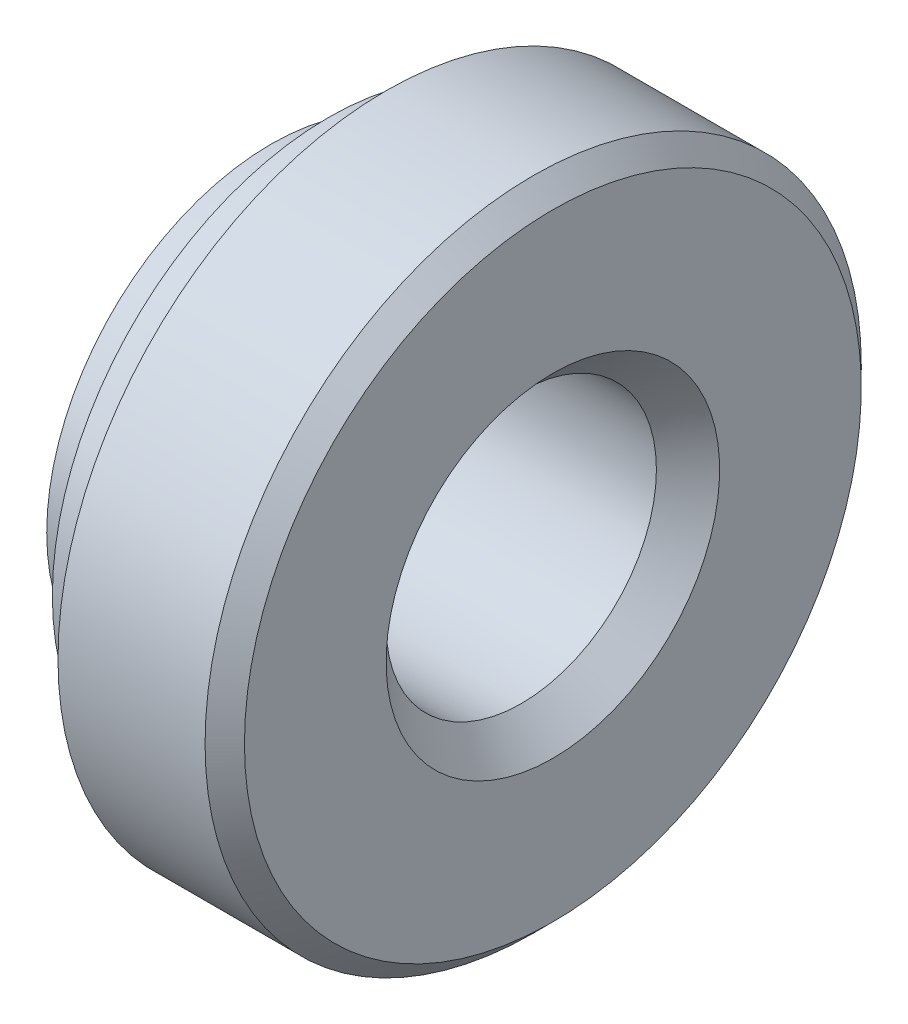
ISO-10303-21;
HEADER;
FILE_DESCRIPTION(('STEP AP214'),'2;1');
FILE_NAME('part.step','',(''),(''),'','','');
FILE_SCHEMA(('AUTOMOTIVE_DESIGN { 1 0 10303 214 1 1 1 1 }'));
ENDSEC;
DATA;
#1=APPLICATION_CONTEXT('core data for automotive mechanical design processes');
#2=APPLICATION_PROTOCOL_DEFINITION('international standard','automotive_design',2000,#1);
#3=PRODUCT_CONTEXT('',#1,'mechanical');
#4=PRODUCT('Part','Part','',(#3));
#5=PRODUCT_RELATED_PRODUCT_CATEGORY('part','',(#4));
#6=PRODUCT_DEFINITION_FORMATION('','',#4);
#7=PRODUCT_DEFINITION_CONTEXT('part definition',#1,'design');
#8=PRODUCT_DEFINITION('design','',#6,#7);
#9=PRODUCT_DEFINITION_SHAPE('','',#8);
#10=(LENGTH_UNIT() NAMED_UNIT(*) SI_UNIT(.MILLI.,.METRE.));
#11=(NAMED_UNIT(*) PLANE_ANGLE_UNIT() SI_UNIT($,.RADIAN.));
#12=(NAMED_UNIT(*) SI_UNIT($,.STERADIAN.) SOLID_ANGLE_UNIT());
#13=UNCERTAINTY_MEASURE_WITH_UNIT(LENGTH_MEASURE(1.E-05),#10,'distance_accuracy_value','');
#14=(GEOMETRIC_REPRESENTATION_CONTEXT(3) GLOBAL_UNCERTAINTY_ASSIGNED_CONTEXT((#13)) GLOBAL_UNIT_ASSIGNED_CONTEXT((#10,
#11,#12)) REPRESENTATION_CONTEXT('',''));
#15=CARTESIAN_POINT('',(0.,0.,0.));
#16=DIRECTION('',(0.,0.,1.));
#17=DIRECTION('',(1.,0.,0.));
#18=AXIS2_PLACEMENT_3D('',#15,#16,#17);
#19=CARTESIAN_POINT('',(0.31846153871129,0.,0.));
#20=DIRECTION('',(-1.,0.,0.));
#21=DIRECTION('',(0.,0.,1.));
#22=AXIS2_PLACEMENT_3D('',#19,#20,#21);
#23=CONICAL_SURFACE('',#22,2.68999999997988,0.120088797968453);
#24=CARTESIAN_POINT('',(0.318461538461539,0.,0.));
#25=DIRECTION('',(1.,0.,0.));
#26=DIRECTION('',(0.,0.,-1.));
#27=AXIS2_PLACEMENT_3D('',#24,#25,#26);
#28=CIRCLE('',#27,2.69);
#29=CARTESIAN_POINT('',(0.318461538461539,0.,-2.69));
#30=VERTEX_POINT('',#29);
#31=EDGE_CURVE('E31',#30,#30,#28,.F.);
#32=ORIENTED_EDGE('',*,*,#31,.F.);
#33=EDGE_LOOP('',(#32));
#34=FACE_BOUND('',#33,.T.);
#35=CARTESIAN_POINT('',(0.690000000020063,0.,0.));
#36=DIRECTION('',(-1.,0.,0.));
#37=DIRECTION('',(0.,0.,1.));
#38=AXIS2_PLACEMENT_3D('',#35,#36,#37);
#39=CIRCLE('',#38,2.64516666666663);
#40=CARTESIAN_POINT('',(0.690000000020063,0.,2.64516666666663));
#41=VERTEX_POINT('',#40);
#42=EDGE_CURVE('E19',#41,#41,#39,.F.);
#43=ORIENTED_EDGE('',*,*,#42,.F.);
#44=EDGE_LOOP('',(#43));
#45=FACE_BOUND('',#44,.T.);
#46=ADVANCED_FACE('F16',(#34,#45),#23,.T.);
#47=CARTESIAN_POINT('',(0.159230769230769,0.,0.));
#48=DIRECTION('',(1.,0.,0.));
#49=DIRECTION('',(0.,0.,-1.));
#50=AXIS2_PLACEMENT_3D('',#47,#48,#49);
#51=CYLINDRICAL_SURFACE('',#50,2.69);
#52=ORIENTED_EDGE('',*,*,#31,.T.);
#53=EDGE_LOOP('',(#52));
#54=FACE_BOUND('',#53,.T.);
#55=CARTESIAN_POINT('',(0.,0.,0.));
#56=DIRECTION('',(1.,0.,0.));
#57=DIRECTION('',(0.,0.,-1.));
#58=AXIS2_PLACEMENT_3D('',#55,#56,#57);
#59=CIRCLE('',#58,2.69);
#60=CARTESIAN_POINT('',(0.,0.,-2.69));
#61=VERTEX_POINT('',#60);
#62=EDGE_CURVE('E47',#61,#61,#59,.F.);
#63=ORIENTED_EDGE('',*,*,#62,.F.);
#64=EDGE_LOOP('',(#63));
#65=FACE_BOUND('',#64,.T.);
#66=ADVANCED_FACE('F57',(#54,#65),#51,.T.);
#67=CARTESIAN_POINT('',(0.69,0.,0.));
#68=DIRECTION('',(-1.,0.,0.));
#69=DIRECTION('',(0.,0.,1.));
#70=AXIS2_PLACEMENT_3D('',#67,#68,#69);
#71=PLANE('',#70);
#72=CARTESIAN_POINT('',(0.69,0.,0.));
#73=DIRECTION('',(-1.,0.,0.));
#74=DIRECTION('',(0.,0.,1.));
#75=AXIS2_PLACEMENT_3D('',#72,#73,#74);
#76=CIRCLE('',#75,3.3125);
#77=CARTESIAN_POINT('',(0.689999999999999,0.,3.3125));
#78=VERTEX_POINT('',#77);
#79=EDGE_CURVE('E45',#78,#78,#76,.F.);
#80=ORIENTED_EDGE('',*,*,#79,.F.);
#81=EDGE_LOOP('',(#80));
#82=FACE_BOUND('',#81,.T.);
#83=ORIENTED_EDGE('',*,*,#42,.T.);
#84=EDGE_LOOP('',(#83));
#85=FACE_BOUND('',#84,.T.);
#86=ADVANCED_FACE('F66',(#82,#85),#71,.T.);
#87=CARTESIAN_POINT('',(0.,0.,1.345));
#88=DIRECTION('',(-1.,0.,0.));
#89=DIRECTION('',(0.,0.,1.));
#90=AXIS2_PLACEMENT_3D('',#87,#88,#89);
#91=PLANE('',#90);
#92=ORIENTED_EDGE('',*,*,#62,.T.);
#93=EDGE_LOOP('',(#92));
#94=FACE_BOUND('',#93,.T.);
#95=CARTESIAN_POINT('',(0.,0.,0.));
#96=DIRECTION('',(-1.,0.,0.));
#97=DIRECTION('',(0.,-1.,0.));
#98=AXIS2_PLACEMENT_3D('',#95,#96,#97);
#99=CIRCLE('',#98,2.00000000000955);
#100=CARTESIAN_POINT('',(0.,-2.00000000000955,0.));
#101=VERTEX_POINT('',#100);
#102=EDGE_CURVE('E42',#101,#101,#99,.F.);
#103=ORIENTED_EDGE('',*,*,#102,.T.);
#104=EDGE_LOOP('',(#103));
#105=FACE_BOUND('',#104,.T.);
#106=ADVANCED_FACE('F101',(#94,#105),#91,.T.);
#107=CARTESIAN_POINT('',(1.035,0.,0.));
#108=DIRECTION('',(-1.,0.,0.));
#109=DIRECTION('',(0.,0.,1.));
#110=AXIS2_PLACEMENT_3D('',#107,#108,#109);
#111=CYLINDRICAL_SURFACE('',#110,3.3125);
#112=CARTESIAN_POINT('',(1.38,0.,0.));
#113=DIRECTION('',(-1.,0.,0.));
#114=DIRECTION('',(0.,0.,1.));
#115=AXIS2_PLACEMENT_3D('',#112,#113,#114);
#116=CIRCLE('',#115,3.3125);
#117=CARTESIAN_POINT('',(1.38,0.,3.3125));
#118=VERTEX_POINT('',#117);
#119=EDGE_CURVE('E39',#118,#118,#116,.F.);
#120=ORIENTED_EDGE('',*,*,#119,.F.);
#121=EDGE_LOOP('',(#120));
#122=FACE_BOUND('',#121,.T.);
#123=ORIENTED_EDGE('',*,*,#79,.T.);
#124=EDGE_LOOP('',(#123));
#125=FACE_BOUND('',#124,.T.);
#126=ADVANCED_FACE('F97',(#122,#125),#111,.T.);
#127=CARTESIAN_POINT('',(0.,0.,0.));
#128=DIRECTION('',(-1.,0.,0.));
#129=DIRECTION('',(0.,-1.,0.));
#130=AXIS2_PLACEMENT_3D('',#127,#128,#129);
#131=CONICAL_SURFACE('',#130,2.00000000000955,0.785398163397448);
#132=ORIENTED_EDGE('',*,*,#102,.F.);
#133=EDGE_LOOP('',(#132));
#134=FACE_BOUND('',#133,.T.);
#135=CARTESIAN_POINT('',(0.379,0.,0.));
#136=DIRECTION('',(-1.,0.,0.));
#137=DIRECTION('',(0.,-1.,0.));
#138=AXIS2_PLACEMENT_3D('',#135,#136,#137);
#139=CIRCLE('',#138,1.621);
#140=CARTESIAN_POINT('',(0.379,-1.621,0.));
#141=VERTEX_POINT('',#140);
#142=EDGE_CURVE('E38',#141,#141,#139,.F.);
#143=ORIENTED_EDGE('',*,*,#142,.T.);
#144=EDGE_LOOP('',(#143));
#145=FACE_BOUND('',#144,.T.);
#146=ADVANCED_FACE('F93',(#134,#145),#131,.F.);
#147=CARTESIAN_POINT('',(1.38,0.,1.9675));
#148=DIRECTION('',(-1.,0.,0.));
#149=DIRECTION('',(0.,0.,1.));
#150=AXIS2_PLACEMENT_3D('',#147,#148,#149);
#151=PLANE('',#150);
#152=CARTESIAN_POINT('',(1.38,0.,0.));
#153=DIRECTION('',(1.,0.,0.));
#154=DIRECTION('',(0.,0.,-1.));
#155=AXIS2_PLACEMENT_3D('',#152,#153,#154);
#156=CIRCLE('',#155,3.935);
#157=CARTESIAN_POINT('',(1.38,0.,-3.935));
#158=VERTEX_POINT('',#157);
#159=EDGE_CURVE('E34',#158,#158,#156,.T.);
#160=ORIENTED_EDGE('',*,*,#159,.F.);
#161=EDGE_LOOP('',(#160));
#162=FACE_BOUND('',#161,.T.);
#163=ORIENTED_EDGE('',*,*,#119,.T.);
#164=EDGE_LOOP('',(#163));
#165=FACE_BOUND('',#164,.T.);
#166=ADVANCED_FACE('F89',(#162,#165),#151,.T.);
#167=CARTESIAN_POINT('',(1.69,0.,0.));
#168=DIRECTION('',(-1.,0.,0.));
#169=DIRECTION('',(0.,-1.,0.));
#170=AXIS2_PLACEMENT_3D('',#167,#168,#169);
#171=CYLINDRICAL_SURFACE('',#170,1.621);
#172=ORIENTED_EDGE('',*,*,#142,.F.);
#173=EDGE_LOOP('',(#172));
#174=FACE_BOUND('',#173,.T.);
#175=CARTESIAN_POINT('',(3.00100000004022,0.,0.));
#176=DIRECTION('',(1.,0.,0.));
#177=DIRECTION('',(0.,0.,1.));
#178=AXIS2_PLACEMENT_3D('',#175,#176,#177);
#179=CIRCLE('',#178,1.62100000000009);
#180=CARTESIAN_POINT('',(3.00100000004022,0.,1.62100000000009));
#181=VERTEX_POINT('',#180);
#182=EDGE_CURVE('E37',#181,#181,#179,.T.);
#183=ORIENTED_EDGE('',*,*,#182,.T.);
#184=EDGE_LOOP('',(#183));
#185=FACE_BOUND('',#184,.T.);
#186=ADVANCED_FACE('F85',(#174,#185),#171,.F.);
#187=CARTESIAN_POINT('',(2.26195,0.,0.));
#188=DIRECTION('',(1.,0.,0.));
#189=DIRECTION('',(0.,0.,-1.));
#190=AXIS2_PLACEMENT_3D('',#187,#188,#189);
#191=CYLINDRICAL_SURFACE('',#190,3.935);
#192=CARTESIAN_POINT('',(3.1439000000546,0.,0.));
#193=DIRECTION('',(-1.,0.,0.));
#194=DIRECTION('',(0.,0.,1.));
#195=AXIS2_PLACEMENT_3D('',#192,#193,#194);
#196=CIRCLE('',#195,3.93500000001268);
#197=CARTESIAN_POINT('',(3.1439000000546,-1.78998852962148E-13,3.93500000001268));
#198=VERTEX_POINT('',#197);
#199=EDGE_CURVE('E28',#198,#198,#196,.F.);
#200=ORIENTED_EDGE('',*,*,#199,.F.);
#201=EDGE_LOOP('',(#200));
#202=FACE_BOUND('',#201,.T.);
#203=ORIENTED_EDGE('',*,*,#159,.T.);
#204=EDGE_LOOP('',(#203));
#205=FACE_BOUND('',#204,.T.);
#206=ADVANCED_FACE('F81',(#202,#205),#191,.T.);
#207=CARTESIAN_POINT('',(3.38000000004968,0.,0.));
#208=DIRECTION('',(1.,0.,0.));
#209=DIRECTION('',(0.,1.,0.));
#210=AXIS2_PLACEMENT_3D('',#207,#208,#209);
#211=CONICAL_SURFACE('',#210,2.00000000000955,0.785398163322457);
#212=ORIENTED_EDGE('',*,*,#182,.F.);
#213=EDGE_LOOP('',(#212));
#214=FACE_BOUND('',#213,.T.);
#215=CARTESIAN_POINT('',(3.38000000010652,0.,0.));
#216=DIRECTION('',(1.,0.,0.));
#217=DIRECTION('',(0.,1.,0.));
#218=AXIS2_PLACEMENT_3D('',#215,#216,#217);
#219=CIRCLE('',#218,2.00000000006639);
#220=CARTESIAN_POINT('',(3.38000000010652,2.00000000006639,0.));
#221=VERTEX_POINT('',#220);
#222=EDGE_CURVE('E23',#221,#221,#219,.F.);
#223=ORIENTED_EDGE('',*,*,#222,.F.);
#224=EDGE_LOOP('',(#223));
#225=FACE_BOUND('',#224,.T.);
#226=ADVANCED_FACE('F74',(#214,#225),#211,.F.);
#227=CARTESIAN_POINT('',(3.1439000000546,0.,0.));
#228=DIRECTION('',(-1.,0.,0.));
#229=DIRECTION('',(0.,0.,1.));
#230=AXIS2_PLACEMENT_3D('',#227,#228,#229);
#231=CONICAL_SURFACE('',#230,3.93500000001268,0.78539816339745);
#232=CARTESIAN_POINT('',(3.38000000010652,0.,0.));
#233=DIRECTION('',(-1.,0.,0.));
#234=DIRECTION('',(0.,0.,1.));
#235=AXIS2_PLACEMENT_3D('',#232,#233,#234);
#236=CIRCLE('',#235,3.69889999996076);
#237=CARTESIAN_POINT('',(3.38000000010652,0.,3.69889999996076));
#238=VERTEX_POINT('',#237);
#239=EDGE_CURVE('E10',#238,#238,#236,.F.);
#240=ORIENTED_EDGE('',*,*,#239,.F.);
#241=EDGE_LOOP('',(#240));
#242=FACE_BOUND('',#241,.T.);
#243=ORIENTED_EDGE('',*,*,#199,.T.);
#244=EDGE_LOOP('',(#243));
#245=FACE_BOUND('',#244,.T.);
#246=ADVANCED_FACE('F69',(#242,#245),#231,.T.);
#247=CARTESIAN_POINT('',(3.38,0.,1.84945));
#248=DIRECTION('',(1.,0.,0.));
#249=DIRECTION('',(0.,0.,-1.));
#250=AXIS2_PLACEMENT_3D('',#247,#248,#249);
#251=PLANE('',#250);
#252=ORIENTED_EDGE('',*,*,#239,.T.);
#253=EDGE_LOOP('',(#252));
#254=FACE_BOUND('',#253,.T.);
#255=ORIENTED_EDGE('',*,*,#222,.T.);
#256=EDGE_LOOP('',(#255));
#257=FACE_BOUND('',#256,.T.);
#258=ADVANCED_FACE('F67',(#254,#257),#251,.T.);
#259=CLOSED_SHELL('',(#46,#66,#86,#106,#126,#146,#166,#186,#206,#226,#246,#258));
#260=MANIFOLD_SOLID_BREP('B1',#259);
#261=ADVANCED_BREP_SHAPE_REPRESENTATION('',(#18,#260),#14);
#262=SHAPE_DEFINITION_REPRESENTATION(#9,#261);
ENDSEC;
END-ISO-10303-21;
